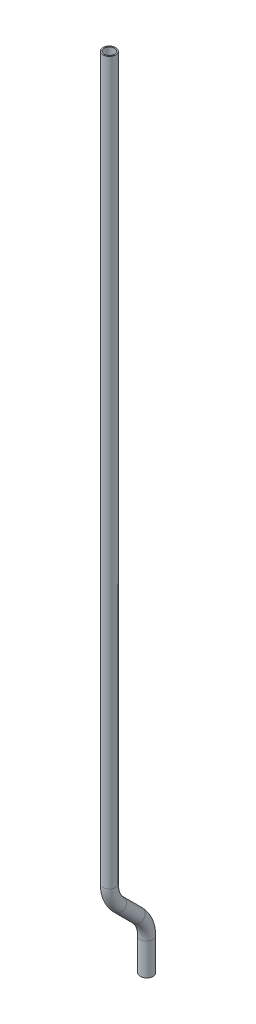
from build123d import *

# Parameters (mm, degrees)
SKETCH2_R   = 4.7625
SKETCH2_R_2 = 3.8735


with BuildPart() as part:
    # Sweep1: sweep along a path in Sketch1
    with BuildLine(Plane(origin=(0, 0, 0), x_dir=(0, 0, -1), z_dir=(1, 0, 0))) as sweep1_path:
        Line((0, 0), (0, 23.8125))
        ThreePointArc((0, 23.8125), (-1.812618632, 32.925149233), (-6.974519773, 40.650480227))
        Line((-6.974519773, 40.650480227), (-20.965480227, 54.641440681))
        ThreePointArc((-20.965480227, 54.641440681), (-26.127381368, 62.366771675), (-27.94, 71.479420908))
        Line((-27.94, 71.479420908), (-27.94, 609.6))
    # Sketch2 → Sweep1 (sweep)
    with BuildSketch(Plane(origin=(0, 0, 0), x_dir=(1, 0, 0), z_dir=(0, 1, 0))):
        Circle(SKETCH2_R)
        Circle(SKETCH2_R_2, mode=Mode.SUBTRACT)
    sweep(path=sweep1_path.line)


solid = part.part
